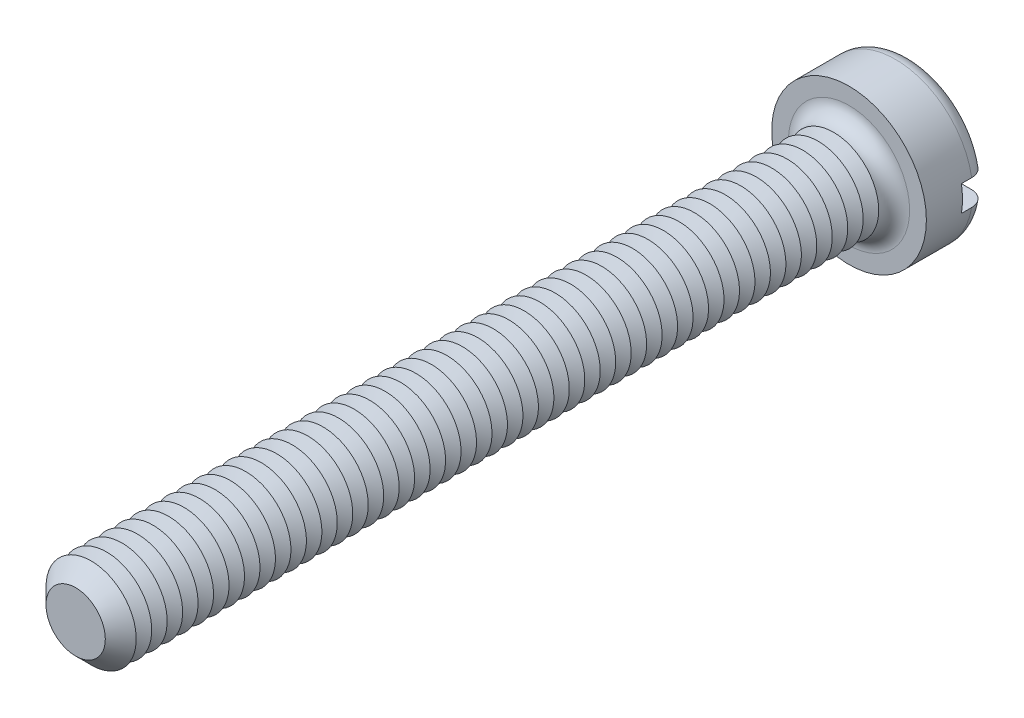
from build123d import *

# Parameters (mm, degrees)
SKETCH3_R           = 3
BOSS_EXTRUDE2_DEPTH = 2.4
SKETCH4_R           = 1.75
BOSS_EXTRUDE3_DEPTH = 30
FILLET1_R           = 0.6
CHAMFER1_SIZE       = 0.6
LPATTERN1_COUNT     = 48
LPATTERN1_PITCH     = 0.6
SKETCH8_W           = 6
SKETCH8_H           = 1
CUT_EXTRUDE1_DEPTH  = 1


with BuildPart() as part:
    # Sketch3 → Boss-Extrude2 (new body)
    with BuildSketch(Plane.XY):
        Circle(SKETCH3_R)
    extrude(amount=-BOSS_EXTRUDE2_DEPTH)

    # Sketch4 → Boss-Extrude3 (add)
    with BuildSketch(Plane.XY):
        Circle(SKETCH4_R)
    extrude(amount=BOSS_EXTRUDE3_DEPTH)

    # Fillet1
    fillet1_edges = [part.edges().sort_by_distance(p)[0] for p in [
        (-3, 0, -2.4),
        (-1.75, 0, 0),
    ]]
    fillet(fillet1_edges, radius=FILLET1_R)

    # Chamfer1
    chamfer1_edges = [part.edges().sort_by_distance(p)[0] for p in [
        (-1.75, 0, 30),
    ]]
    chamfer(chamfer1_edges, length=CHAMFER1_SIZE)

    # Sketch6 → Cut-Revolve1 (revolve, cut)
    with BuildSketch(Plane(origin=(0, 0, 0), x_dir=(0, 0, -1), z_dir=(1, 0, 0)), mode=Mode.PRIVATE) as cut_revolve1_sk:
        Polygon((-0.6, 1.75), (-0.9, 1.230384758), (-1.2, 1.75), align=None)
    cut_revolve1 = revolve(cut_revolve1_sk.sketch.rotate(Axis((0, 0, -1.694361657), (0, 0, 1)), 90), axis=Axis((0, 0, -1.694361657), (0, 0, 1)), mode=Mode.SUBTRACT)

    # LPattern1: Cut-Revolve1 ×48
    with Locations(*[(0, 0, i * LPATTERN1_PITCH) for i in range(1, LPATTERN1_COUNT)]):
        add(cut_revolve1, mode=Mode.SUBTRACT)

    # Sketch8 → Cut-Extrude1 (cut)
    with BuildSketch(Plane(origin=(0, 0, -2.4), x_dir=(-1, 0, 0), z_dir=(0, 0, -1))):
        Rectangle(SKETCH8_W, SKETCH8_H)
    extrude(amount=-CUT_EXTRUDE1_DEPTH, mode=Mode.SUBTRACT)


solid = part.part
